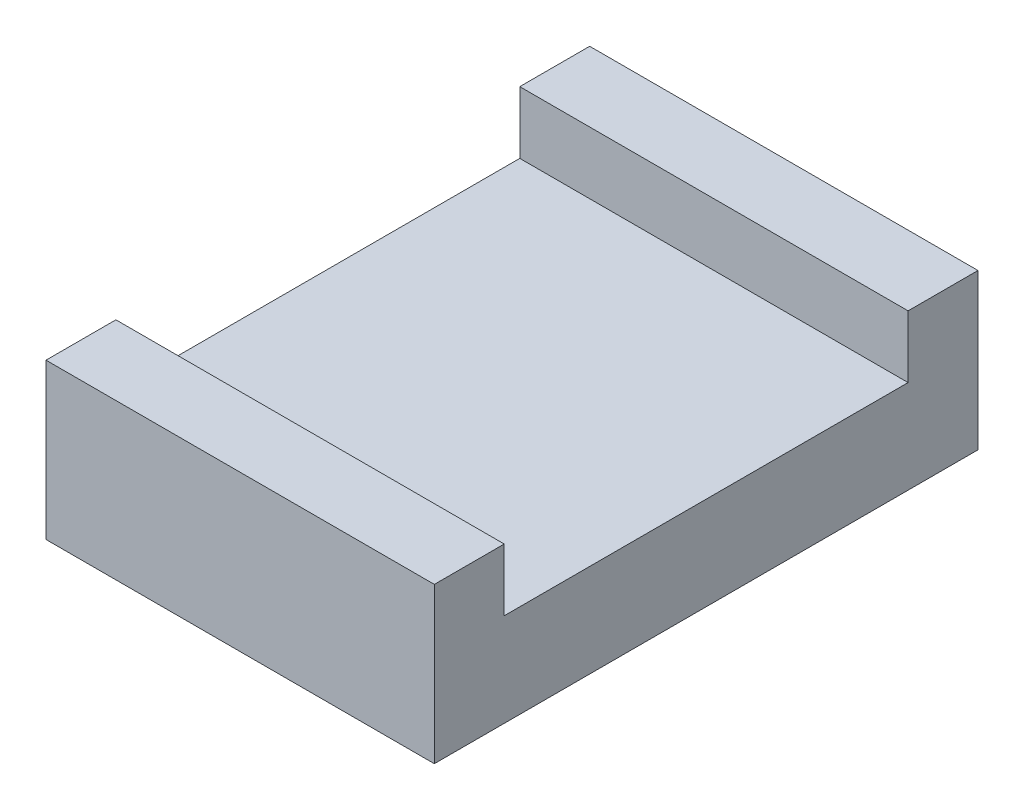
ISO-10303-21;
HEADER;
FILE_DESCRIPTION(('STEP AP214'),'2;1');
FILE_NAME('part.step','',(''),(''),'','','');
FILE_SCHEMA(('AUTOMOTIVE_DESIGN { 1 0 10303 214 1 1 1 1 }'));
ENDSEC;
DATA;
#1=APPLICATION_CONTEXT('core data for automotive mechanical design processes');
#2=APPLICATION_PROTOCOL_DEFINITION('international standard','automotive_design',2000,#1);
#3=PRODUCT_CONTEXT('',#1,'mechanical');
#4=PRODUCT('Part','Part','',(#3));
#5=PRODUCT_RELATED_PRODUCT_CATEGORY('part','',(#4));
#6=PRODUCT_DEFINITION_FORMATION('','',#4);
#7=PRODUCT_DEFINITION_CONTEXT('part definition',#1,'design');
#8=PRODUCT_DEFINITION('design','',#6,#7);
#9=PRODUCT_DEFINITION_SHAPE('','',#8);
#10=(LENGTH_UNIT() NAMED_UNIT(*) SI_UNIT(.MILLI.,.METRE.));
#11=(NAMED_UNIT(*) PLANE_ANGLE_UNIT() SI_UNIT($,.RADIAN.));
#12=(NAMED_UNIT(*) SI_UNIT($,.STERADIAN.) SOLID_ANGLE_UNIT());
#13=UNCERTAINTY_MEASURE_WITH_UNIT(LENGTH_MEASURE(1.E-05),#10,'distance_accuracy_value','');
#14=(GEOMETRIC_REPRESENTATION_CONTEXT(3) GLOBAL_UNCERTAINTY_ASSIGNED_CONTEXT((#13)) GLOBAL_UNIT_ASSIGNED_CONTEXT((#10,
#11,#12)) REPRESENTATION_CONTEXT('',''));
#15=CARTESIAN_POINT('',(0.,0.,0.));
#16=DIRECTION('',(0.,0.,1.));
#17=DIRECTION('',(1.,0.,0.));
#18=AXIS2_PLACEMENT_3D('',#15,#16,#17);
#19=CARTESIAN_POINT('',(25.,20.,35.));
#20=DIRECTION('',(0.,0.,-1.));
#21=DIRECTION('',(0.,1.,0.));
#22=AXIS2_PLACEMENT_3D('',#19,#20,#21);
#23=PLANE('',#22);
#24=DIRECTION('',(0.,-1.,0.));
#25=VECTOR('',#24,1.);
#26=CARTESIAN_POINT('',(-25.,20.,35.));
#27=LINE('',#26,#25);
#28=CARTESIAN_POINT('',(-25.,20.,35.));
#29=VERTEX_POINT('',#28);
#30=CARTESIAN_POINT('',(-25.,0.,35.));
#31=VERTEX_POINT('',#30);
#32=EDGE_CURVE('E135',#29,#31,#27,.T.);
#33=ORIENTED_EDGE('',*,*,#32,.T.);
#34=DIRECTION('',(-1.,0.,0.));
#35=VECTOR('',#34,1.);
#36=CARTESIAN_POINT('',(25.,0.,35.));
#37=LINE('',#36,#35);
#38=CARTESIAN_POINT('',(25.,0.,35.));
#39=VERTEX_POINT('',#38);
#40=EDGE_CURVE('E11',#39,#31,#37,.T.);
#41=ORIENTED_EDGE('',*,*,#40,.F.);
#42=DIRECTION('',(0.,-1.,0.));
#43=VECTOR('',#42,1.);
#44=CARTESIAN_POINT('',(25.,20.,35.));
#45=LINE('',#44,#43);
#46=CARTESIAN_POINT('',(25.,20.,35.));
#47=VERTEX_POINT('',#46);
#48=EDGE_CURVE('E149',#47,#39,#45,.T.);
#49=ORIENTED_EDGE('',*,*,#48,.F.);
#50=DIRECTION('',(-1.,0.,0.));
#51=VECTOR('',#50,1.);
#52=CARTESIAN_POINT('',(25.,20.,35.));
#53=LINE('',#52,#51);
#54=EDGE_CURVE('E131',#47,#29,#53,.T.);
#55=ORIENTED_EDGE('',*,*,#54,.T.);
#56=EDGE_LOOP('',(#33,#41,#49,#55));
#57=FACE_BOUND('',#56,.T.);
#58=ADVANCED_FACE('F39',(#57),#23,.F.);
#59=CARTESIAN_POINT('',(25.,0.,35.));
#60=DIRECTION('',(0.,1.,0.));
#61=DIRECTION('',(0.,0.,1.));
#62=AXIS2_PLACEMENT_3D('',#59,#60,#61);
#63=PLANE('',#62);
#64=DIRECTION('',(0.,0.,-1.));
#65=VECTOR('',#64,1.);
#66=CARTESIAN_POINT('',(-25.,0.,35.));
#67=LINE('',#66,#65);
#68=CARTESIAN_POINT('',(-25.,0.,-35.));
#69=VERTEX_POINT('',#68);
#70=EDGE_CURVE('E138',#31,#69,#67,.T.);
#71=ORIENTED_EDGE('',*,*,#70,.T.);
#72=DIRECTION('',(-1.,0.,0.));
#73=VECTOR('',#72,1.);
#74=CARTESIAN_POINT('',(25.,0.,-35.));
#75=LINE('',#74,#73);
#76=CARTESIAN_POINT('',(25.,0.,-35.));
#77=VERTEX_POINT('',#76);
#78=EDGE_CURVE('E47',#77,#69,#75,.T.);
#79=ORIENTED_EDGE('',*,*,#78,.F.);
#80=DIRECTION('',(0.,0.,-1.));
#81=VECTOR('',#80,1.);
#82=CARTESIAN_POINT('',(25.,0.,35.));
#83=LINE('',#82,#81);
#84=EDGE_CURVE('E98',#39,#77,#83,.T.);
#85=ORIENTED_EDGE('',*,*,#84,.F.);
#86=ORIENTED_EDGE('',*,*,#40,.T.);
#87=EDGE_LOOP('',(#71,#79,#85,#86));
#88=FACE_BOUND('',#87,.T.);
#89=ADVANCED_FACE('F184',(#88),#63,.F.);
#90=CARTESIAN_POINT('',(25.,0.,-35.));
#91=DIRECTION('',(0.,0.,1.));
#92=DIRECTION('',(0.,-1.,0.));
#93=AXIS2_PLACEMENT_3D('',#90,#91,#92);
#94=PLANE('',#93);
#95=DIRECTION('',(0.,1.,0.));
#96=VECTOR('',#95,1.);
#97=CARTESIAN_POINT('',(-25.,0.,-35.));
#98=LINE('',#97,#96);
#99=CARTESIAN_POINT('',(-25.,20.,-35.));
#100=VERTEX_POINT('',#99);
#101=EDGE_CURVE('E140',#69,#100,#98,.T.);
#102=ORIENTED_EDGE('',*,*,#101,.T.);
#103=DIRECTION('',(-1.,0.,0.));
#104=VECTOR('',#103,1.);
#105=CARTESIAN_POINT('',(25.,20.,-35.));
#106=LINE('',#105,#104);
#107=CARTESIAN_POINT('',(25.,20.,-35.));
#108=VERTEX_POINT('',#107);
#109=EDGE_CURVE('E156',#108,#100,#106,.T.);
#110=ORIENTED_EDGE('',*,*,#109,.F.);
#111=DIRECTION('',(0.,1.,0.));
#112=VECTOR('',#111,1.);
#113=CARTESIAN_POINT('',(25.,0.,-35.));
#114=LINE('',#113,#112);
#115=EDGE_CURVE('E164',#77,#108,#114,.T.);
#116=ORIENTED_EDGE('',*,*,#115,.F.);
#117=ORIENTED_EDGE('',*,*,#78,.T.);
#118=EDGE_LOOP('',(#102,#110,#116,#117));
#119=FACE_BOUND('',#118,.T.);
#120=ADVANCED_FACE('F162',(#119),#94,.F.);
#121=CARTESIAN_POINT('',(25.,20.,-35.));
#122=DIRECTION('',(0.,-1.,0.));
#123=DIRECTION('',(0.,0.,-1.));
#124=AXIS2_PLACEMENT_3D('',#121,#122,#123);
#125=PLANE('',#124);
#126=DIRECTION('',(0.,0.,1.));
#127=VECTOR('',#126,1.);
#128=CARTESIAN_POINT('',(-25.,20.,-35.));
#129=LINE('',#128,#127);
#130=CARTESIAN_POINT('',(-25.,20.,-26.));
#131=VERTEX_POINT('',#130);
#132=EDGE_CURVE('E142',#100,#131,#129,.T.);
#133=ORIENTED_EDGE('',*,*,#132,.T.);
#134=DIRECTION('',(-1.,0.,0.));
#135=VECTOR('',#134,1.);
#136=CARTESIAN_POINT('',(25.,20.,-26.));
#137=LINE('',#136,#135);
#138=CARTESIAN_POINT('',(25.,20.,-26.));
#139=VERTEX_POINT('',#138);
#140=EDGE_CURVE('E153',#139,#131,#137,.T.);
#141=ORIENTED_EDGE('',*,*,#140,.F.);
#142=DIRECTION('',(0.,0.,1.));
#143=VECTOR('',#142,1.);
#144=CARTESIAN_POINT('',(25.,20.,-35.));
#145=LINE('',#144,#143);
#146=EDGE_CURVE('E176',#108,#139,#145,.T.);
#147=ORIENTED_EDGE('',*,*,#146,.F.);
#148=ORIENTED_EDGE('',*,*,#109,.T.);
#149=EDGE_LOOP('',(#133,#141,#147,#148));
#150=FACE_BOUND('',#149,.T.);
#151=ADVANCED_FACE('F172',(#150),#125,.F.);
#152=CARTESIAN_POINT('',(25.,20.,-26.));
#153=DIRECTION('',(0.,0.,-1.));
#154=DIRECTION('',(0.,1.,0.));
#155=AXIS2_PLACEMENT_3D('',#152,#153,#154);
#156=PLANE('',#155);
#157=DIRECTION('',(0.,-1.,0.));
#158=VECTOR('',#157,1.);
#159=CARTESIAN_POINT('',(-25.,20.,-26.));
#160=LINE('',#159,#158);
#161=CARTESIAN_POINT('',(-25.,12.,-26.));
#162=VERTEX_POINT('',#161);
#163=EDGE_CURVE('E144',#131,#162,#160,.T.);
#164=ORIENTED_EDGE('',*,*,#163,.T.);
#165=DIRECTION('',(-1.,0.,0.));
#166=VECTOR('',#165,1.);
#167=CARTESIAN_POINT('',(25.,12.,-26.));
#168=LINE('',#167,#166);
#169=CARTESIAN_POINT('',(25.,12.,-26.));
#170=VERTEX_POINT('',#169);
#171=EDGE_CURVE('E126',#170,#162,#168,.T.);
#172=ORIENTED_EDGE('',*,*,#171,.F.);
#173=DIRECTION('',(0.,-1.,0.));
#174=VECTOR('',#173,1.);
#175=CARTESIAN_POINT('',(25.,20.,-26.));
#176=LINE('',#175,#174);
#177=EDGE_CURVE('E117',#139,#170,#176,.T.);
#178=ORIENTED_EDGE('',*,*,#177,.F.);
#179=ORIENTED_EDGE('',*,*,#140,.T.);
#180=EDGE_LOOP('',(#164,#172,#178,#179));
#181=FACE_BOUND('',#180,.T.);
#182=ADVANCED_FACE('F175',(#181),#156,.F.);
#183=CARTESIAN_POINT('',(25.,12.,-26.));
#184=DIRECTION('',(0.,-1.,0.));
#185=DIRECTION('',(0.,0.,-1.));
#186=AXIS2_PLACEMENT_3D('',#183,#184,#185);
#187=PLANE('',#186);
#188=DIRECTION('',(0.,0.,1.));
#189=VECTOR('',#188,1.);
#190=CARTESIAN_POINT('',(-25.,12.,-26.));
#191=LINE('',#190,#189);
#192=CARTESIAN_POINT('',(-25.,12.,26.));
#193=VERTEX_POINT('',#192);
#194=EDGE_CURVE('E125',#162,#193,#191,.T.);
#195=ORIENTED_EDGE('',*,*,#194,.T.);
#196=DIRECTION('',(-1.,0.,0.));
#197=VECTOR('',#196,1.);
#198=CARTESIAN_POINT('',(25.,12.,26.));
#199=LINE('',#198,#197);
#200=CARTESIAN_POINT('',(25.,12.,26.));
#201=VERTEX_POINT('',#200);
#202=EDGE_CURVE('E122',#201,#193,#199,.T.);
#203=ORIENTED_EDGE('',*,*,#202,.F.);
#204=DIRECTION('',(0.,0.,1.));
#205=VECTOR('',#204,1.);
#206=CARTESIAN_POINT('',(25.,12.,-26.));
#207=LINE('',#206,#205);
#208=EDGE_CURVE('E111',#170,#201,#207,.T.);
#209=ORIENTED_EDGE('',*,*,#208,.F.);
#210=ORIENTED_EDGE('',*,*,#171,.T.);
#211=EDGE_LOOP('',(#195,#203,#209,#210));
#212=FACE_BOUND('',#211,.T.);
#213=ADVANCED_FACE('F123',(#212),#187,.F.);
#214=CARTESIAN_POINT('',(25.,12.,26.));
#215=DIRECTION('',(0.,0.,1.));
#216=DIRECTION('',(1.,0.,0.));
#217=AXIS2_PLACEMENT_3D('',#214,#215,#216);
#218=PLANE('',#217);
#219=DIRECTION('',(0.,1.,0.));
#220=VECTOR('',#219,1.);
#221=CARTESIAN_POINT('',(-25.,12.,26.));
#222=LINE('',#221,#220);
#223=CARTESIAN_POINT('',(-25.,20.,26.));
#224=VERTEX_POINT('',#223);
#225=EDGE_CURVE('E84',#193,#224,#222,.T.);
#226=ORIENTED_EDGE('',*,*,#225,.T.);
#227=DIRECTION('',(-1.,0.,0.));
#228=VECTOR('',#227,1.);
#229=CARTESIAN_POINT('',(25.,20.,26.));
#230=LINE('',#229,#228);
#231=CARTESIAN_POINT('',(25.,20.,26.));
#232=VERTEX_POINT('',#231);
#233=EDGE_CURVE('E127',#232,#224,#230,.T.);
#234=ORIENTED_EDGE('',*,*,#233,.F.);
#235=DIRECTION('',(0.,1.,0.));
#236=VECTOR('',#235,1.);
#237=CARTESIAN_POINT('',(25.,12.,26.));
#238=LINE('',#237,#236);
#239=EDGE_CURVE('E115',#201,#232,#238,.T.);
#240=ORIENTED_EDGE('',*,*,#239,.F.);
#241=ORIENTED_EDGE('',*,*,#202,.T.);
#242=EDGE_LOOP('',(#226,#234,#240,#241));
#243=FACE_BOUND('',#242,.T.);
#244=ADVANCED_FACE('F129',(#243),#218,.F.);
#245=CARTESIAN_POINT('',(25.,20.,26.));
#246=DIRECTION('',(0.,-1.,0.));
#247=DIRECTION('',(0.,0.,-1.));
#248=AXIS2_PLACEMENT_3D('',#245,#246,#247);
#249=PLANE('',#248);
#250=DIRECTION('',(0.,0.,1.));
#251=VECTOR('',#250,1.);
#252=CARTESIAN_POINT('',(-25.,20.,26.));
#253=LINE('',#252,#251);
#254=EDGE_CURVE('E90',#224,#29,#253,.T.);
#255=ORIENTED_EDGE('',*,*,#254,.T.);
#256=ORIENTED_EDGE('',*,*,#54,.F.);
#257=DIRECTION('',(0.,0.,1.));
#258=VECTOR('',#257,1.);
#259=CARTESIAN_POINT('',(25.,20.,26.));
#260=LINE('',#259,#258);
#261=EDGE_CURVE('E55',#232,#47,#260,.T.);
#262=ORIENTED_EDGE('',*,*,#261,.F.);
#263=ORIENTED_EDGE('',*,*,#233,.T.);
#264=EDGE_LOOP('',(#255,#256,#262,#263));
#265=FACE_BOUND('',#264,.T.);
#266=ADVANCED_FACE('F200',(#265),#249,.F.);
#267=CARTESIAN_POINT('',(25.,0.,0.));
#268=DIRECTION('',(1.,0.,0.));
#269=DIRECTION('',(0.,0.,-1.));
#270=AXIS2_PLACEMENT_3D('',#267,#268,#269);
#271=PLANE('',#270);
#272=ORIENTED_EDGE('',*,*,#48,.T.);
#273=ORIENTED_EDGE('',*,*,#84,.T.);
#274=ORIENTED_EDGE('',*,*,#115,.T.);
#275=ORIENTED_EDGE('',*,*,#146,.T.);
#276=ORIENTED_EDGE('',*,*,#177,.T.);
#277=ORIENTED_EDGE('',*,*,#208,.T.);
#278=ORIENTED_EDGE('',*,*,#239,.T.);
#279=ORIENTED_EDGE('',*,*,#261,.T.);
#280=EDGE_LOOP('',(#272,#273,#274,#275,#276,#277,#278,#279));
#281=FACE_BOUND('',#280,.T.);
#282=ADVANCED_FACE('F113',(#281),#271,.T.);
#283=CARTESIAN_POINT('',(-25.,0.,0.));
#284=DIRECTION('',(1.,0.,0.));
#285=DIRECTION('',(0.,0.,-1.));
#286=AXIS2_PLACEMENT_3D('',#283,#284,#285);
#287=PLANE('',#286);
#288=ORIENTED_EDGE('',*,*,#32,.F.);
#289=ORIENTED_EDGE('',*,*,#254,.F.);
#290=ORIENTED_EDGE('',*,*,#225,.F.);
#291=ORIENTED_EDGE('',*,*,#194,.F.);
#292=ORIENTED_EDGE('',*,*,#163,.F.);
#293=ORIENTED_EDGE('',*,*,#132,.F.);
#294=ORIENTED_EDGE('',*,*,#101,.F.);
#295=ORIENTED_EDGE('',*,*,#70,.F.);
#296=EDGE_LOOP('',(#288,#289,#290,#291,#292,#293,#294,#295));
#297=FACE_BOUND('',#296,.T.);
#298=ADVANCED_FACE('F168',(#297),#287,.F.);
#299=CLOSED_SHELL('',(#58,#89,#120,#151,#182,#213,#244,#266,#282,#298));
#300=MANIFOLD_SOLID_BREP('B2',#299);
#301=ADVANCED_BREP_SHAPE_REPRESENTATION('',(#18,#300),#14);
#302=SHAPE_DEFINITION_REPRESENTATION(#9,#301);
ENDSEC;
END-ISO-10303-21;
